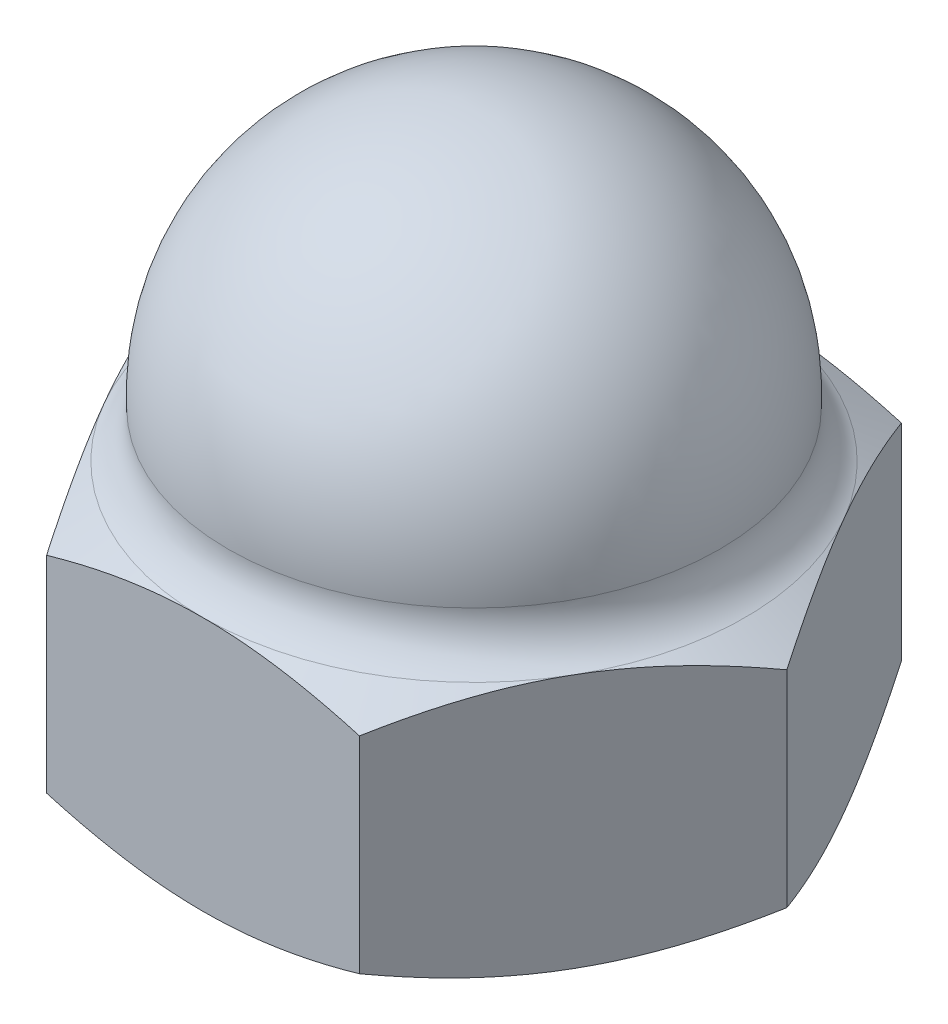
from build123d import *

# Parameters (mm, degrees)
ESQUISSE2_OUTSIDE_W     = 31.828
ESQUISSE2_OUTSIDE_H     = 31.828
HEXAGONE_DEPTH          = 8
ESQUISSE7_R             = 5
ENL_V_MAT_EXTRU_3_DEPTH = 8.8
CHANFREIN1_SIZE         = 1


with BuildPart() as part:
    # Esquisse1 → Base (revolve)
    with BuildSketch(Plane.XY, mode=Mode.PRIVATE) as base_sk:
        with BuildLine():
            Line((8, 7.511517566), (11.313708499, 5.598347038))
            Line((11.313708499, 5.598347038), (11.313708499, 1.913170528))
            Line((11.313708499, 1.913170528), (8, 0))
            Line((8, 0), (3.700961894, 0))
            Line((3.700961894, 0), (3.700961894, 12.125))
            Line((3.700961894, 12.125), (0, 14.261751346))
            Line((0, 14.261751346), (0, 16.5))
            ThreePointArc((0, 16.5), (5.258137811, 14.2461835), (7.25179909, 8.883999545))
            ThreePointArc((7.25179909, 8.883999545), (7.432984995, 8.092592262), (8, 7.511517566))
        make_face()
    revolve(base_sk.sketch.rotate(Axis((0, 0, 0), (0, 1, 0)), 90), axis=Axis((0, 0, 0), (0, 1, 0)))

    # Esquisse2 outside → Hexagone (cut)
    with BuildSketch(Plane(origin=(0, 0, 0), x_dir=(1, 0, 0), z_dir=(0, 1, 0))):
        Rectangle(ESQUISSE2_OUTSIDE_W, ESQUISSE2_OUTSIDE_H)
        Polygon((-4.618802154, -8), (4.618802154, -8), (9.237604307, 0), (4.618802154, 8), (-4.618802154, 8), (-9.237604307, 0), align=None, mode=Mode.SUBTRACT)
    extrude(amount=HEXAGONE_DEPTH, mode=Mode.SUBTRACT)

    # Esquisse7 → Enl_v. mat.-Extru.3 (cut)
    with BuildSketch(Plane.XZ):
        Circle(ESQUISSE7_R)
    extrude(amount=-ENL_V_MAT_EXTRU_3_DEPTH, mode=Mode.SUBTRACT)

    # Chanfrein1
    chanfrein1_edges = [part.edges().sort_by_distance(p)[0] for p in [
        (-5, 8.8, 0),
    ]]
    chamfer(chanfrein1_edges, length=CHANFREIN1_SIZE)


solid = part.part
